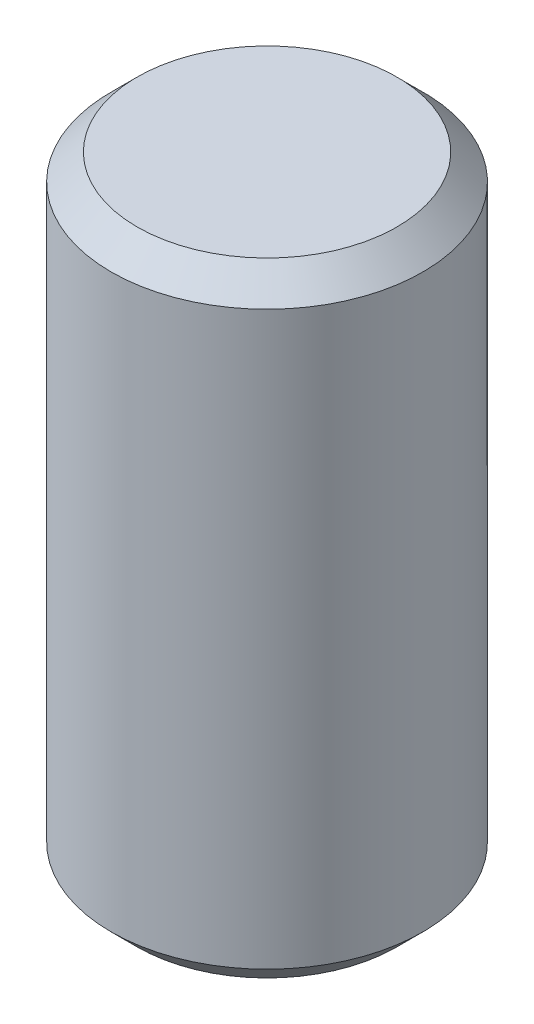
from build123d import *

# Parameters (mm, degrees)
SKETCH1_R           = 1.5
BOSS_EXTRUDE1_DEPTH = 6
CHAMFER1_SIZE       = 0.25


with BuildPart() as part:
    # Sketch1 → Boss-Extrude1 (new body)
    with BuildSketch(Plane(origin=(0, 0, 0), x_dir=(1, 0, 0), z_dir=(0, 1, 0))):
        with Locations(Location((0, 0, 0), (0, 0, 270))):
            Circle(SKETCH1_R)
    extrude(amount=BOSS_EXTRUDE1_DEPTH)

    # Chamfer1
    chamfer1_edges = [part.edges().sort_by_distance(p)[0] for p in [
        (0, 0, -1.5),
        (0, 6, -1.5),
    ]]
    chamfer(chamfer1_edges, length=CHAMFER1_SIZE)


solid = part.part
